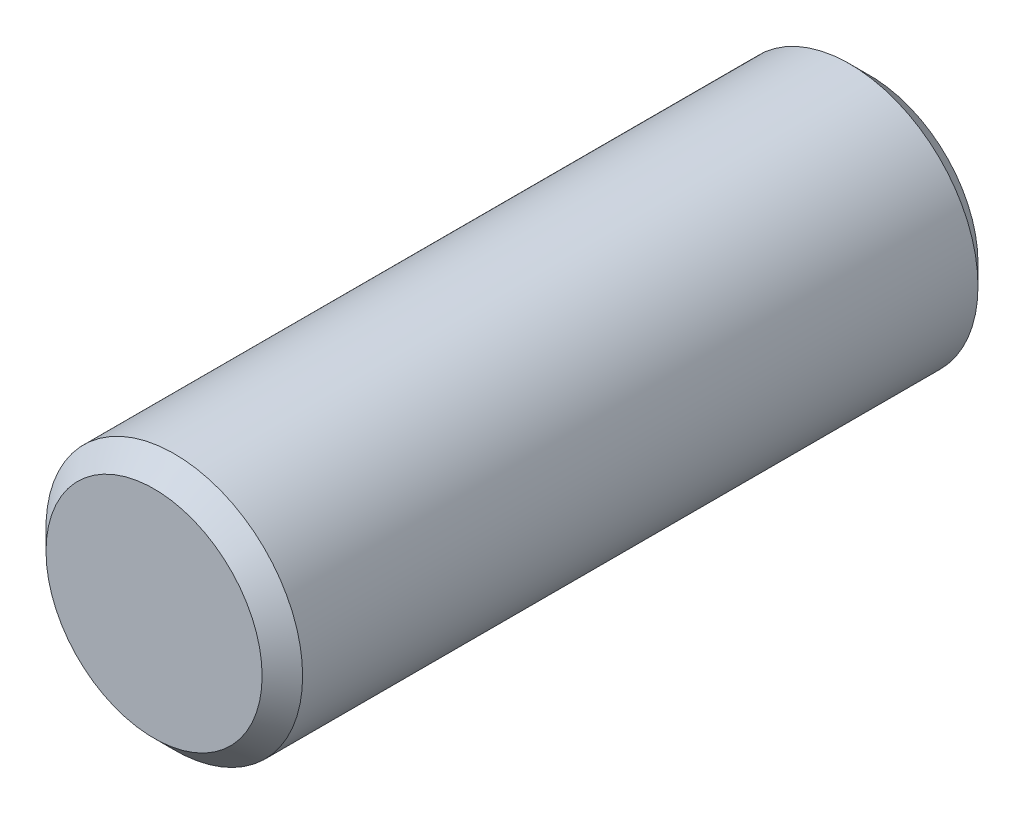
ISO-10303-21;
HEADER;
FILE_DESCRIPTION(('STEP AP214'),'2;1');
FILE_NAME('part.step','',(''),(''),'','','');
FILE_SCHEMA(('AUTOMOTIVE_DESIGN { 1 0 10303 214 1 1 1 1 }'));
ENDSEC;
DATA;
#1=APPLICATION_CONTEXT('core data for automotive mechanical design processes');
#2=APPLICATION_PROTOCOL_DEFINITION('international standard','automotive_design',2000,#1);
#3=PRODUCT_CONTEXT('',#1,'mechanical');
#4=PRODUCT('Part','Part','',(#3));
#5=PRODUCT_RELATED_PRODUCT_CATEGORY('part','',(#4));
#6=PRODUCT_DEFINITION_FORMATION('','',#4);
#7=PRODUCT_DEFINITION_CONTEXT('part definition',#1,'design');
#8=PRODUCT_DEFINITION('design','',#6,#7);
#9=PRODUCT_DEFINITION_SHAPE('','',#8);
#10=(LENGTH_UNIT() NAMED_UNIT(*) SI_UNIT(.MILLI.,.METRE.));
#11=(NAMED_UNIT(*) PLANE_ANGLE_UNIT() SI_UNIT($,.RADIAN.));
#12=(NAMED_UNIT(*) SI_UNIT($,.STERADIAN.) SOLID_ANGLE_UNIT());
#13=UNCERTAINTY_MEASURE_WITH_UNIT(LENGTH_MEASURE(1.E-05),#10,'distance_accuracy_value','');
#14=(GEOMETRIC_REPRESENTATION_CONTEXT(3) GLOBAL_UNCERTAINTY_ASSIGNED_CONTEXT((#13)) GLOBAL_UNIT_ASSIGNED_CONTEXT((#10,
#11,#12)) REPRESENTATION_CONTEXT('',''));
#15=CARTESIAN_POINT('',(0.,0.,0.));
#16=DIRECTION('',(0.,0.,1.));
#17=DIRECTION('',(1.,0.,0.));
#18=AXIS2_PLACEMENT_3D('',#15,#16,#17);
#19=CARTESIAN_POINT('',(0.,0.,13.462));
#20=DIRECTION('',(0.,0.,-1.));
#21=DIRECTION('',(-1.,0.,0.));
#22=AXIS2_PLACEMENT_3D('',#19,#20,#21);
#23=CYLINDRICAL_SURFACE('',#22,4.826);
#24=CARTESIAN_POINT('',(0.,0.,-4.572));
#25=DIRECTION('',(0.,0.,1.));
#26=DIRECTION('',(1.,0.,0.));
#27=AXIS2_PLACEMENT_3D('',#24,#25,#26);
#28=CIRCLE('',#27,4.826);
#29=CARTESIAN_POINT('',(-2.96212356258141,-3.81,-4.572));
#30=VERTEX_POINT('',#29);
#31=CARTESIAN_POINT('',(2.96212356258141,-3.81,-4.572));
#32=VERTEX_POINT('',#31);
#33=EDGE_CURVE('E64',#30,#32,#28,.T.);
#34=ORIENTED_EDGE('',*,*,#33,.T.);
#35=DIRECTION('',(0.,0.,-1.));
#36=VECTOR('',#35,1.);
#37=CARTESIAN_POINT('',(2.96212356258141,-3.81,13.462));
#38=LINE('',#37,#36);
#39=CARTESIAN_POINT('',(2.96212356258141,-3.81,-9.652));
#40=VERTEX_POINT('',#39);
#41=EDGE_CURVE('E11',#32,#40,#38,.T.);
#42=ORIENTED_EDGE('',*,*,#41,.T.);
#43=CARTESIAN_POINT('',(0.,0.,-9.652));
#44=DIRECTION('',(0.,0.,-1.));
#45=DIRECTION('',(-1.,0.,0.));
#46=AXIS2_PLACEMENT_3D('',#43,#44,#45);
#47=CIRCLE('',#46,4.826);
#48=CARTESIAN_POINT('',(-2.96212356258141,-3.81,-9.652));
#49=VERTEX_POINT('',#48);
#50=EDGE_CURVE('E40',#40,#49,#47,.T.);
#51=ORIENTED_EDGE('',*,*,#50,.T.);
#52=DIRECTION('',(0.,0.,-1.));
#53=VECTOR('',#52,1.);
#54=CARTESIAN_POINT('',(-2.96212356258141,-3.81,13.462));
#55=LINE('',#54,#53);
#56=EDGE_CURVE('E69',#49,#30,#55,.F.);
#57=ORIENTED_EDGE('',*,*,#56,.T.);
#58=EDGE_LOOP('',(#34,#42,#51,#57));
#59=FACE_BOUND('',#58,.T.);
#60=CARTESIAN_POINT('',(0.,0.,-12.7));
#61=DIRECTION('',(0.,0.,1.));
#62=DIRECTION('',(1.,0.,0.));
#63=AXIS2_PLACEMENT_3D('',#60,#61,#62);
#64=CIRCLE('',#63,4.826);
#65=CARTESIAN_POINT('',(4.826,0.,-12.7));
#66=VERTEX_POINT('',#65);
#67=EDGE_CURVE('E79',#66,#66,#64,.T.);
#68=ORIENTED_EDGE('',*,*,#67,.T.);
#69=EDGE_LOOP('',(#68));
#70=FACE_BOUND('',#69,.T.);
#71=CARTESIAN_POINT('',(0.,0.,12.7));
#72=DIRECTION('',(0.,0.,1.));
#73=DIRECTION('',(1.,0.,0.));
#74=AXIS2_PLACEMENT_3D('',#71,#72,#73);
#75=CIRCLE('',#74,4.826);
#76=CARTESIAN_POINT('',(4.826,0.,12.7));
#77=VERTEX_POINT('',#76);
#78=EDGE_CURVE('E66',#77,#77,#75,.F.);
#79=ORIENTED_EDGE('',*,*,#78,.T.);
#80=EDGE_LOOP('',(#79));
#81=FACE_BOUND('',#80,.T.);
#82=ADVANCED_FACE('F32',(#59,#70,#81),#23,.T.);
#83=CARTESIAN_POINT('',(0.,0.,13.462));
#84=DIRECTION('',(0.,0.,1.));
#85=DIRECTION('',(1.,0.,0.));
#86=AXIS2_PLACEMENT_3D('',#83,#84,#85);
#87=PLANE('',#86);
#88=CARTESIAN_POINT('',(0.,0.,13.462));
#89=DIRECTION('',(0.,0.,1.));
#90=DIRECTION('',(1.,0.,0.));
#91=AXIS2_PLACEMENT_3D('',#88,#89,#90);
#92=CIRCLE('',#91,4.06400000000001);
#93=CARTESIAN_POINT('',(4.06400000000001,0.,13.462));
#94=VERTEX_POINT('',#93);
#95=EDGE_CURVE('E71',#94,#94,#92,.T.);
#96=ORIENTED_EDGE('',*,*,#95,.T.);
#97=EDGE_LOOP('',(#96));
#98=FACE_BOUND('',#97,.T.);
#99=ADVANCED_FACE('F93',(#98),#87,.T.);
#100=CARTESIAN_POINT('',(0.,0.,-13.462));
#101=DIRECTION('',(0.,0.,1.));
#102=DIRECTION('',(1.,0.,0.));
#103=AXIS2_PLACEMENT_3D('',#100,#101,#102);
#104=PLANE('',#103);
#105=CARTESIAN_POINT('',(0.,0.,-13.462));
#106=DIRECTION('',(0.,0.,1.));
#107=DIRECTION('',(1.,0.,0.));
#108=AXIS2_PLACEMENT_3D('',#105,#106,#107);
#109=CIRCLE('',#108,4.064);
#110=CARTESIAN_POINT('',(4.064,0.,-13.462));
#111=VERTEX_POINT('',#110);
#112=EDGE_CURVE('E76',#111,#111,#109,.F.);
#113=ORIENTED_EDGE('',*,*,#112,.T.);
#114=EDGE_LOOP('',(#113));
#115=FACE_BOUND('',#114,.T.);
#116=ADVANCED_FACE('F95',(#115),#104,.F.);
#117=CARTESIAN_POINT('',(0.,0.,-12.7));
#118=DIRECTION('',(0.,0.,1.));
#119=DIRECTION('',(1.,0.,0.));
#120=AXIS2_PLACEMENT_3D('',#117,#118,#119);
#121=CONICAL_SURFACE('',#120,4.826,0.785398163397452);
#122=ORIENTED_EDGE('',*,*,#112,.F.);
#123=EDGE_LOOP('',(#122));
#124=FACE_BOUND('',#123,.T.);
#125=ORIENTED_EDGE('',*,*,#67,.F.);
#126=EDGE_LOOP('',(#125));
#127=FACE_BOUND('',#126,.T.);
#128=ADVANCED_FACE('F90',(#124,#127),#121,.T.);
#129=CARTESIAN_POINT('',(0.,0.,13.462));
#130=DIRECTION('',(0.,0.,-1.));
#131=DIRECTION('',(-1.,0.,0.));
#132=AXIS2_PLACEMENT_3D('',#129,#130,#131);
#133=CONICAL_SURFACE('',#132,4.06400000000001,0.785398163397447);
#134=ORIENTED_EDGE('',*,*,#78,.F.);
#135=EDGE_LOOP('',(#134));
#136=FACE_BOUND('',#135,.T.);
#137=ORIENTED_EDGE('',*,*,#95,.F.);
#138=EDGE_LOOP('',(#137));
#139=FACE_BOUND('',#138,.T.);
#140=ADVANCED_FACE('F34',(#136,#139),#133,.T.);
#141=CARTESIAN_POINT('',(-4.826,-5.69297723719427,-9.652));
#142=DIRECTION('',(0.,0.,-1.));
#143=DIRECTION('',(-1.,0.,0.));
#144=AXIS2_PLACEMENT_3D('',#141,#142,#143);
#145=PLANE('',#144);
#146=DIRECTION('',(1.,0.,0.));
#147=VECTOR('',#146,1.);
#148=CARTESIAN_POINT('',(-4.826,-3.81,-9.652));
#149=LINE('',#148,#147);
#150=EDGE_CURVE('E59',#49,#40,#149,.T.);
#151=ORIENTED_EDGE('',*,*,#150,.F.);
#152=ORIENTED_EDGE('',*,*,#50,.F.);
#153=EDGE_LOOP('',(#151,#152));
#154=FACE_BOUND('',#153,.T.);
#155=ADVANCED_FACE('F89',(#154),#145,.F.);
#156=CARTESIAN_POINT('',(-4.826,-5.69297723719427,-4.572));
#157=DIRECTION('',(0.,0.,1.));
#158=DIRECTION('',(1.,0.,0.));
#159=AXIS2_PLACEMENT_3D('',#156,#157,#158);
#160=PLANE('',#159);
#161=DIRECTION('',(1.,0.,0.));
#162=VECTOR('',#161,1.);
#163=CARTESIAN_POINT('',(-4.826,-3.81,-4.572));
#164=LINE('',#163,#162);
#165=EDGE_CURVE('E47',#30,#32,#164,.T.);
#166=ORIENTED_EDGE('',*,*,#165,.T.);
#167=ORIENTED_EDGE('',*,*,#33,.F.);
#168=EDGE_LOOP('',(#166,#167));
#169=FACE_BOUND('',#168,.T.);
#170=ADVANCED_FACE('F63',(#169),#160,.F.);
#171=CARTESIAN_POINT('',(-4.826,-3.81,-4.572));
#172=DIRECTION('',(0.,1.,0.));
#173=DIRECTION('',(0.,0.,1.));
#174=AXIS2_PLACEMENT_3D('',#171,#172,#173);
#175=PLANE('',#174);
#176=ORIENTED_EDGE('',*,*,#165,.F.);
#177=ORIENTED_EDGE('',*,*,#56,.F.);
#178=ORIENTED_EDGE('',*,*,#150,.T.);
#179=ORIENTED_EDGE('',*,*,#41,.F.);
#180=EDGE_LOOP('',(#176,#177,#178,#179));
#181=FACE_BOUND('',#180,.T.);
#182=ADVANCED_FACE('F58',(#181),#175,.F.);
#183=CLOSED_SHELL('',(#82,#99,#116,#128,#140,#155,#170,#182));
#184=MANIFOLD_SOLID_BREP('B2',#183);
#185=ADVANCED_BREP_SHAPE_REPRESENTATION('',(#18,#184),#14);
#186=SHAPE_DEFINITION_REPRESENTATION(#9,#185);
ENDSEC;
END-ISO-10303-21;
